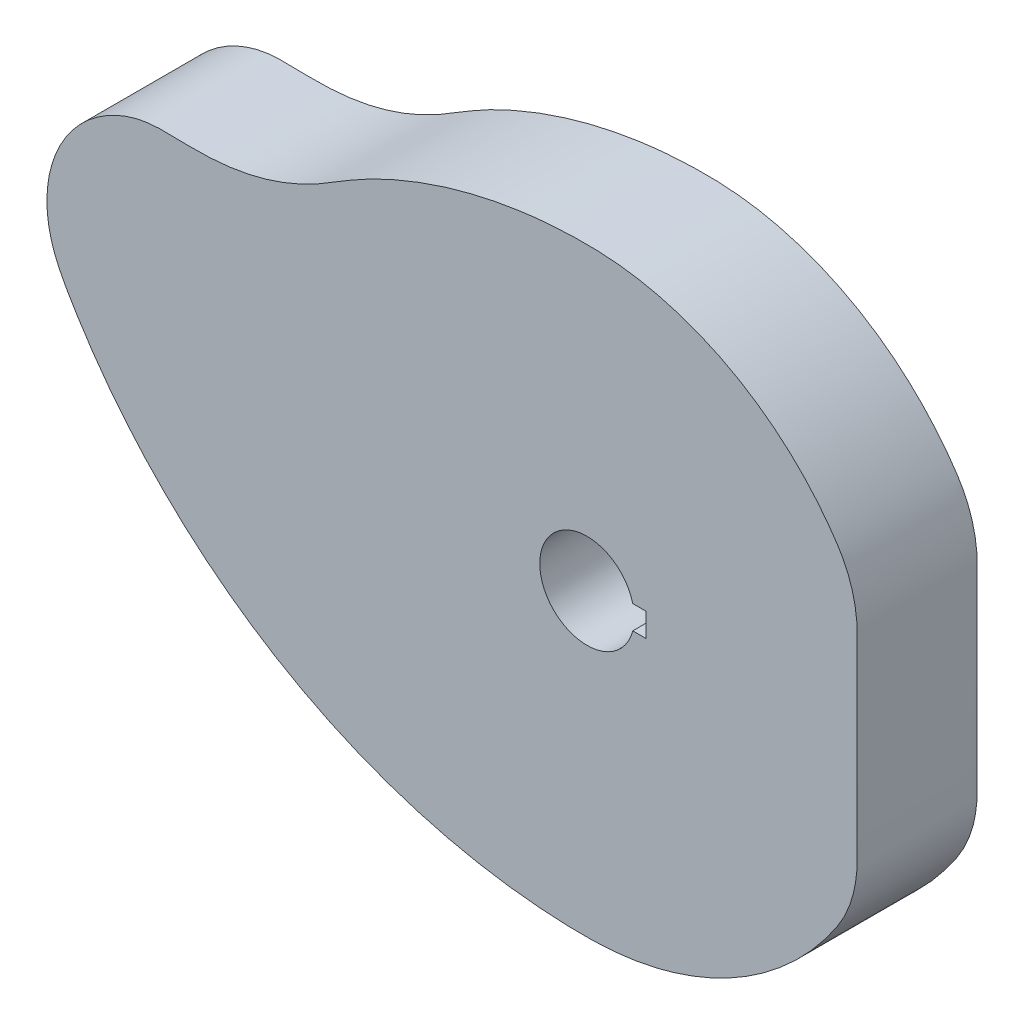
ISO-10303-21;
HEADER;
FILE_DESCRIPTION(('STEP AP214'),'2;1');
FILE_NAME('part.step','',(''),(''),'','','');
FILE_SCHEMA(('AUTOMOTIVE_DESIGN { 1 0 10303 214 1 1 1 1 }'));
ENDSEC;
DATA;
#1=APPLICATION_CONTEXT('core data for automotive mechanical design processes');
#2=APPLICATION_PROTOCOL_DEFINITION('international standard','automotive_design',2000,#1);
#3=PRODUCT_CONTEXT('',#1,'mechanical');
#4=PRODUCT('Part','Part','',(#3));
#5=PRODUCT_RELATED_PRODUCT_CATEGORY('part','',(#4));
#6=PRODUCT_DEFINITION_FORMATION('','',#4);
#7=PRODUCT_DEFINITION_CONTEXT('part definition',#1,'design');
#8=PRODUCT_DEFINITION('design','',#6,#7);
#9=PRODUCT_DEFINITION_SHAPE('','',#8);
#10=(LENGTH_UNIT() NAMED_UNIT(*) SI_UNIT(.MILLI.,.METRE.));
#11=(NAMED_UNIT(*) PLANE_ANGLE_UNIT() SI_UNIT($,.RADIAN.));
#12=(NAMED_UNIT(*) SI_UNIT($,.STERADIAN.) SOLID_ANGLE_UNIT());
#13=UNCERTAINTY_MEASURE_WITH_UNIT(LENGTH_MEASURE(1.E-05),#10,'distance_accuracy_value','');
#14=(GEOMETRIC_REPRESENTATION_CONTEXT(3) GLOBAL_UNCERTAINTY_ASSIGNED_CONTEXT((#13)) GLOBAL_UNIT_ASSIGNED_CONTEXT((#10,
#11,#12)) REPRESENTATION_CONTEXT('',''));
#15=CARTESIAN_POINT('',(0.,0.,0.));
#16=DIRECTION('',(0.,0.,1.));
#17=DIRECTION('',(1.,0.,0.));
#18=AXIS2_PLACEMENT_3D('',#15,#16,#17);
#19=CARTESIAN_POINT('',(-52.1978161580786,-121.578735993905,25.4));
#20=DIRECTION('',(0.,0.,-1.));
#21=DIRECTION('',(-1.,0.,0.));
#22=AXIS2_PLACEMENT_3D('',#19,#20,#21);
#23=PLANE('',#22);
#24=CARTESIAN_POINT('',(-28.84960940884,124.941592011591,25.4));
#25=CARTESIAN_POINT('',(-48.0172973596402,122.192382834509,25.4));
#26=CARTESIAN_POINT('',(-66.6004944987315,116.749663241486,25.4));
#27=CARTESIAN_POINT('',(-84.2227067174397,108.723702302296,25.4));
#28=CARTESIAN_POINT('',(-88.8344062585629,106.623323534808,25.4));
#29=CARTESIAN_POINT('',(-97.900665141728,102.077540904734,25.4));
#30=CARTESIAN_POINT('',(-110.693663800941,93.768091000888,25.4));
#31=CARTESIAN_POINT('',(-119.707980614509,89.0740002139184,25.4));
#32=CARTESIAN_POINT('',(-124.364668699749,87.0753457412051,25.4));
#33=CARTESIAN_POINT('',(-134.644197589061,82.6633632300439,25.4));
#34=CARTESIAN_POINT('',(-145.507212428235,79.9933047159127,25.4));
#35=CARTESIAN_POINT('',(-156.660747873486,79.1371791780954,25.4));
#36=CARTESIAN_POINT('',(-161.496559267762,78.7659908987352,25.4));
#37=CARTESIAN_POINT('',(-171.221339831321,78.7161496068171,25.4));
#38=CARTESIAN_POINT('',(-186.352461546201,79.4198612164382,25.4));
#39=CARTESIAN_POINT('',(-195.681579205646,76.4217455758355,25.4));
#40=CARTESIAN_POINT('',(-200.042029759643,74.2982287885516,25.4));
#41=CARTESIAN_POINT('',(-217.372093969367,65.8585774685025,25.4));
#42=CARTESIAN_POINT('',(-227.881133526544,49.6994027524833,25.4));
#43=CARTESIAN_POINT('',(-228.567760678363,30.4357742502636,25.4));
#44=CARTESIAN_POINT('',(-228.780109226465,24.4782417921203,25.4));
#45=CARTESIAN_POINT('',(-227.107479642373,12.4884203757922,25.4));
#46=CARTESIAN_POINT('',(-217.756575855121,-4.16730423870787,25.4));
#47=CARTESIAN_POINT('',(-211.244905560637,-14.1634767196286,25.4));
#48=CARTESIAN_POINT('',(-207.81736266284,-19.0408976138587,25.4));
#49=CARTESIAN_POINT('',(-165.939670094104,-78.6331883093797,25.4));
#50=CARTESIAN_POINT('',(-103.494941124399,-116.125028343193,25.4));
#51=CARTESIAN_POINT('',(-31.2116151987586,-125.075058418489,25.4));
#52=CARTESIAN_POINT('',(-24.352559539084,-125.924338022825,25.4));
#53=CARTESIAN_POINT('',(-10.5651205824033,-127.062984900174,25.4));
#54=CARTESIAN_POINT('',(10.5782783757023,-127.128584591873,25.4));
#55=CARTESIAN_POINT('',(24.2591569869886,-124.852958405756,25.4));
#56=CARTESIAN_POINT('',(30.9620496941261,-123.167980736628,25.4));
#57=CARTESIAN_POINT('',(59.4391898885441,-116.009378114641,25.4));
#58=CARTESIAN_POINT('',(83.8974747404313,-99.7617503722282,25.4));
#59=CARTESIAN_POINT('',(101.535282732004,-76.2862134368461,25.4));
#60=CARTESIAN_POINT('',(102.527158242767,-74.9660488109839,25.4));
#61=CARTESIAN_POINT('',(104.459414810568,-72.2870303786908,25.4));
#62=CARTESIAN_POINT('',(107.224849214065,-68.1400403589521,25.4));
#63=CARTESIAN_POINT('',(108.775057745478,-65.2195286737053,25.4));
#64=CARTESIAN_POINT('',(109.47729400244,-63.7250334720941,25.4));
#65=CARTESIAN_POINT('',(111.593713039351,-59.2208825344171,25.4));
#66=CARTESIAN_POINT('',(113.030335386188,-54.456145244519,25.4));
#67=CARTESIAN_POINT('',(113.756415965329,-49.5327914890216,25.4));
#68=CARTESIAN_POINT('',(113.876888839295,-48.7158978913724,25.4));
#69=CARTESIAN_POINT('',(114.077999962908,-47.0762360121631,25.4));
#70=CARTESIAN_POINT('',(114.3,-44.5983227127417,25.4));
#71=CARTESIAN_POINT('',(114.3,-42.9468641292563,25.4));
#72=CARTESIAN_POINT('',(114.3,-42.1211348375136,25.4));
#73=CARTESIAN_POINT('',(114.3,-41.2954055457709,25.4));
#74=CARTESIAN_POINT('',(114.3,-39.6439469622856,25.4));
#75=CARTESIAN_POINT('',(114.3,-37.1667590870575,25.4));
#76=CARTESIAN_POINT('',(114.3,-35.5153005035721,25.4));
#77=CARTESIAN_POINT('',(114.3,-34.6895712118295,25.4));
#78=CARTESIAN_POINT('',(114.3,-11.5631904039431,25.4));
#79=CARTESIAN_POINT('',(114.3,11.5631904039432,25.4));
#80=CARTESIAN_POINT('',(114.3,34.6895712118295,25.4));
#81=CARTESIAN_POINT('',(114.3,35.5153005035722,25.4));
#82=CARTESIAN_POINT('',(114.3,37.1667590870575,25.4));
#83=CARTESIAN_POINT('',(114.3,39.6439469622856,25.4));
#84=CARTESIAN_POINT('',(114.3,41.2954055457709,25.4));
#85=CARTESIAN_POINT('',(114.3,42.1211348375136,25.4));
#86=CARTESIAN_POINT('',(114.3,42.9468641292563,25.4));
#87=CARTESIAN_POINT('',(114.3,44.5983227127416,25.4));
#88=CARTESIAN_POINT('',(114.077999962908,47.076236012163,25.4));
#89=CARTESIAN_POINT('',(113.876888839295,48.7158978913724,25.4));
#90=CARTESIAN_POINT('',(113.756415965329,49.5327914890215,25.4));
#91=CARTESIAN_POINT('',(113.030335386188,54.456145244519,25.4));
#92=CARTESIAN_POINT('',(111.593713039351,59.2208825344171,25.4));
#93=CARTESIAN_POINT('',(109.47729400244,63.7250334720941,25.4));
#94=CARTESIAN_POINT('',(108.775057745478,65.2195286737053,25.4));
#95=CARTESIAN_POINT('',(107.224849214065,68.1400403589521,25.4));
#96=CARTESIAN_POINT('',(104.459414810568,72.2870303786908,25.4));
#97=CARTESIAN_POINT('',(102.527158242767,74.9660488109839,25.4));
#98=CARTESIAN_POINT('',(101.535282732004,76.2862134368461,25.4));
#99=CARTESIAN_POINT('',(83.8974747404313,99.7617503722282,25.4));
#100=CARTESIAN_POINT('',(59.4391898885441,116.009378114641,25.4));
#101=CARTESIAN_POINT('',(30.962049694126,123.167980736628,25.4));
#102=CARTESIAN_POINT('',(24.5140011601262,124.788895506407,25.4));
#103=CARTESIAN_POINT('',(11.3633313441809,127.01802686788,25.4));
#104=CARTESIAN_POINT('',(-9.01302025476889,127.127434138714,25.4));
#105=CARTESIAN_POINT('',(-22.2682989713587,125.885545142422,25.4));
#106=CARTESIAN_POINT('',(-28.84960940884,124.941592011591,25.4));
#107=(BOUNDED_CURVE() B_SPLINE_CURVE(3,(#24,#25,#26,#27,#28,#29,#30,#31,#32,#33,#34,#35,#36,#37,
#38,#39,#40,#41,#42,#43,#44,#45,#46,#47,#48,#49,#50,#51,#52,#53,#54,#55,#56,#57,#58,#59,#60,#61,
#62,#63,#64,#65,#66,#67,#68,#69,#70,#71,#72,#73,#74,#75,#76,#77,#78,#79,#80,#81,#82,#83,#84,#85,
#86,#87,#88,#89,#90,#91,#92,#93,#94,#95,#96,#97,#98,#99,#100,#101,#102,#103,#104,#105,#106),
.UNSPECIFIED.,.T.,.F.) B_SPLINE_CURVE_WITH_KNOTS((4,3,1,1,3,3,1,1,3,3,1,1,3,3,1,1,3,3,1,1,3,3,1,
1,3,1,1,3,3,1,1,3,1,1,3,3,1,1,3,3,1,1,4),(0.,0.0612421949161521,0.0773781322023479,
0.0935140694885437,0.109650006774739,0.144949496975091,0.160393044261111,0.175836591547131,
0.19128013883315,0.246815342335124,0.265797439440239,0.284779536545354,0.30376163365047,
0.522402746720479,0.54441022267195,0.566417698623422,0.588425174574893,0.678353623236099,
0.683611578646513,0.688869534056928,0.694127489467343,0.70986101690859,0.712490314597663,
0.715119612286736,0.717748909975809,0.720378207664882,0.723007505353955,0.725636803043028,
0.799276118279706,0.801905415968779,0.804534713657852,0.807164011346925,0.809793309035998,
0.812422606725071,0.815051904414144,0.830785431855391,0.836043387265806,0.84130134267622,
0.846559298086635,0.936487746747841,0.957658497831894,0.978829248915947,1.),
.UNSPECIFIED.) CURVE() GEOMETRIC_REPRESENTATION_ITEM() RATIONAL_B_SPLINE_CURVE((1.,
0.993246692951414,0.993246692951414,1.,1.,1.,1.,1.,1.,0.991010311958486,0.991010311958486,1.,1.,
1.,1.,1.,1.,0.904799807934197,0.904799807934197,1.,1.,1.,1.,1.,1.,0.942731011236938,
0.942731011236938,1.,1.,1.,1.,1.,1.,0.961817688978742,0.961817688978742,1.,1.,1.,1.,1.,1.,
0.992866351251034,0.992866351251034,1.,1.,1.,1.,1.,1.,1.,1.,1.,1.,1.,1.,1.,1.,1.,1.,1.,1.,1.,1.,
1.,1.,1.,1.,0.992866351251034,0.992866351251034,1.,1.,1.,1.,1.,1.,0.961817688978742,
0.961817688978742,1.,1.,1.,1.,1.,1.)) REPRESENTATION_ITEM(''));
#108=CARTESIAN_POINT('',(-28.84960940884,124.941592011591,25.4));
#109=VERTEX_POINT('',#108);
#110=EDGE_CURVE('E11',#109,#109,#107,.T.);
#111=ORIENTED_EDGE('',*,*,#110,.T.);
#112=EDGE_LOOP('',(#111));
#113=FACE_BOUND('',#112,.T.);
#114=DIRECTION('',(0.,1.,0.));
#115=VECTOR('',#114,1.);
#116=CARTESIAN_POINT('',(25.,5.,25.4));
#117=LINE('',#116,#115);
#118=CARTESIAN_POINT('',(25.,-5.,25.4));
#119=VERTEX_POINT('',#118);
#120=CARTESIAN_POINT('',(25.,5.,25.4));
#121=VERTEX_POINT('',#120);
#122=EDGE_CURVE('E75',#119,#121,#117,.T.);
#123=ORIENTED_EDGE('',*,*,#122,.F.);
#124=DIRECTION('',(1.,0.,0.));
#125=VECTOR('',#124,1.);
#126=CARTESIAN_POINT('',(19.3649167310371,-5.,25.4));
#127=LINE('',#126,#125);
#128=CARTESIAN_POINT('',(19.3649167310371,-5.,25.4));
#129=VERTEX_POINT('',#128);
#130=EDGE_CURVE('E96',#129,#119,#127,.T.);
#131=ORIENTED_EDGE('',*,*,#130,.F.);
#132=CARTESIAN_POINT('',(0.,0.,25.4));
#133=DIRECTION('',(0.,0.,1.));
#134=DIRECTION('',(1.,0.,0.));
#135=AXIS2_PLACEMENT_3D('',#132,#133,#134);
#136=CIRCLE('',#135,20.);
#137=CARTESIAN_POINT('',(19.3649167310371,5.,25.4));
#138=VERTEX_POINT('',#137);
#139=EDGE_CURVE('E94',#138,#129,#136,.T.);
#140=ORIENTED_EDGE('',*,*,#139,.F.);
#141=DIRECTION('',(-1.,0.,0.));
#142=VECTOR('',#141,1.);
#143=CARTESIAN_POINT('',(19.3649167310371,5.,25.4));
#144=LINE('',#143,#142);
#145=EDGE_CURVE('E83',#121,#138,#144,.T.);
#146=ORIENTED_EDGE('',*,*,#145,.F.);
#147=EDGE_LOOP('',(#123,#131,#140,#146));
#148=FACE_BOUND('',#147,.T.);
#149=ADVANCED_FACE('F32',(#113,#148),#23,.F.);
#150=CARTESIAN_POINT('',(-52.1978161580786,-121.578735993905,-25.4));
#151=DIRECTION('',(0.,0.,-1.));
#152=DIRECTION('',(-1.,0.,0.));
#153=AXIS2_PLACEMENT_3D('',#150,#151,#152);
#154=PLANE('',#153);
#155=CARTESIAN_POINT('',(-28.84960940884,124.941592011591,-25.4));
#156=CARTESIAN_POINT('',(-48.0172973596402,122.192382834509,-25.4));
#157=CARTESIAN_POINT('',(-66.6004944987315,116.749663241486,-25.4));
#158=CARTESIAN_POINT('',(-84.2227067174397,108.723702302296,-25.4));
#159=CARTESIAN_POINT('',(-88.8344062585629,106.623323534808,-25.4));
#160=CARTESIAN_POINT('',(-97.900665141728,102.077540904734,-25.4));
#161=CARTESIAN_POINT('',(-110.693663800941,93.768091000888,-25.4));
#162=CARTESIAN_POINT('',(-119.707980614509,89.0740002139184,-25.4));
#163=CARTESIAN_POINT('',(-124.364668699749,87.0753457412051,-25.4));
#164=CARTESIAN_POINT('',(-134.644197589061,82.6633632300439,-25.4));
#165=CARTESIAN_POINT('',(-145.507212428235,79.9933047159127,-25.4));
#166=CARTESIAN_POINT('',(-156.660747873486,79.1371791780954,-25.4));
#167=CARTESIAN_POINT('',(-161.496559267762,78.7659908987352,-25.4));
#168=CARTESIAN_POINT('',(-171.221339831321,78.7161496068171,-25.4));
#169=CARTESIAN_POINT('',(-186.352461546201,79.4198612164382,-25.4));
#170=CARTESIAN_POINT('',(-195.681579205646,76.4217455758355,-25.4));
#171=CARTESIAN_POINT('',(-200.042029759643,74.2982287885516,-25.4));
#172=CARTESIAN_POINT('',(-217.372093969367,65.8585774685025,-25.4));
#173=CARTESIAN_POINT('',(-227.881133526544,49.6994027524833,-25.4));
#174=CARTESIAN_POINT('',(-228.567760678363,30.4357742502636,-25.4));
#175=CARTESIAN_POINT('',(-228.780109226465,24.4782417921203,-25.4));
#176=CARTESIAN_POINT('',(-227.107479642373,12.4884203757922,-25.4));
#177=CARTESIAN_POINT('',(-217.756575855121,-4.16730423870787,-25.4));
#178=CARTESIAN_POINT('',(-211.244905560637,-14.1634767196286,-25.4));
#179=CARTESIAN_POINT('',(-207.81736266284,-19.0408976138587,-25.4));
#180=CARTESIAN_POINT('',(-165.939670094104,-78.6331883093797,-25.4));
#181=CARTESIAN_POINT('',(-103.494941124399,-116.125028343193,-25.4));
#182=CARTESIAN_POINT('',(-31.2116151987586,-125.075058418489,-25.4));
#183=CARTESIAN_POINT('',(-24.352559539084,-125.924338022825,-25.4));
#184=CARTESIAN_POINT('',(-10.5651205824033,-127.062984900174,-25.4));
#185=CARTESIAN_POINT('',(10.5782783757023,-127.128584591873,-25.4));
#186=CARTESIAN_POINT('',(24.2591569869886,-124.852958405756,-25.4));
#187=CARTESIAN_POINT('',(30.9620496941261,-123.167980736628,-25.4));
#188=CARTESIAN_POINT('',(59.4391898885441,-116.009378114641,-25.4));
#189=CARTESIAN_POINT('',(83.8974747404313,-99.7617503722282,-25.4));
#190=CARTESIAN_POINT('',(101.535282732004,-76.2862134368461,-25.4));
#191=CARTESIAN_POINT('',(102.527158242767,-74.9660488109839,-25.4));
#192=CARTESIAN_POINT('',(104.459414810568,-72.2870303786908,-25.4));
#193=CARTESIAN_POINT('',(107.224849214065,-68.1400403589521,-25.4));
#194=CARTESIAN_POINT('',(108.775057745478,-65.2195286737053,-25.4));
#195=CARTESIAN_POINT('',(109.47729400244,-63.7250334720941,-25.4));
#196=CARTESIAN_POINT('',(111.593713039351,-59.2208825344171,-25.4));
#197=CARTESIAN_POINT('',(113.030335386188,-54.456145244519,-25.4));
#198=CARTESIAN_POINT('',(113.756415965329,-49.5327914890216,-25.4));
#199=CARTESIAN_POINT('',(113.876888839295,-48.7158978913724,-25.4));
#200=CARTESIAN_POINT('',(114.077999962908,-47.0762360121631,-25.4));
#201=CARTESIAN_POINT('',(114.3,-44.5983227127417,-25.4));
#202=CARTESIAN_POINT('',(114.3,-42.9468641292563,-25.4));
#203=CARTESIAN_POINT('',(114.3,-42.1211348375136,-25.4));
#204=CARTESIAN_POINT('',(114.3,-41.2954055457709,-25.4));
#205=CARTESIAN_POINT('',(114.3,-39.6439469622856,-25.4));
#206=CARTESIAN_POINT('',(114.3,-37.1667590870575,-25.4));
#207=CARTESIAN_POINT('',(114.3,-35.5153005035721,-25.4));
#208=CARTESIAN_POINT('',(114.3,-34.6895712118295,-25.4));
#209=CARTESIAN_POINT('',(114.3,-11.5631904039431,-25.4));
#210=CARTESIAN_POINT('',(114.3,11.5631904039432,-25.4));
#211=CARTESIAN_POINT('',(114.3,34.6895712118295,-25.4));
#212=CARTESIAN_POINT('',(114.3,35.5153005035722,-25.4));
#213=CARTESIAN_POINT('',(114.3,37.1667590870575,-25.4));
#214=CARTESIAN_POINT('',(114.3,39.6439469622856,-25.4));
#215=CARTESIAN_POINT('',(114.3,41.2954055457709,-25.4));
#216=CARTESIAN_POINT('',(114.3,42.1211348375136,-25.4));
#217=CARTESIAN_POINT('',(114.3,42.9468641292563,-25.4));
#218=CARTESIAN_POINT('',(114.3,44.5983227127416,-25.4));
#219=CARTESIAN_POINT('',(114.077999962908,47.076236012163,-25.4));
#220=CARTESIAN_POINT('',(113.876888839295,48.7158978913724,-25.4));
#221=CARTESIAN_POINT('',(113.756415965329,49.5327914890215,-25.4));
#222=CARTESIAN_POINT('',(113.030335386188,54.456145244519,-25.4));
#223=CARTESIAN_POINT('',(111.593713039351,59.2208825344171,-25.4));
#224=CARTESIAN_POINT('',(109.47729400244,63.7250334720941,-25.4));
#225=CARTESIAN_POINT('',(108.775057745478,65.2195286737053,-25.4));
#226=CARTESIAN_POINT('',(107.224849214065,68.1400403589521,-25.4));
#227=CARTESIAN_POINT('',(104.459414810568,72.2870303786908,-25.4));
#228=CARTESIAN_POINT('',(102.527158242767,74.9660488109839,-25.4));
#229=CARTESIAN_POINT('',(101.535282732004,76.2862134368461,-25.4));
#230=CARTESIAN_POINT('',(83.8974747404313,99.7617503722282,-25.4));
#231=CARTESIAN_POINT('',(59.4391898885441,116.009378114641,-25.4));
#232=CARTESIAN_POINT('',(30.962049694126,123.167980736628,-25.4));
#233=CARTESIAN_POINT('',(24.5140011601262,124.788895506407,-25.4));
#234=CARTESIAN_POINT('',(11.3633313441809,127.01802686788,-25.4));
#235=CARTESIAN_POINT('',(-9.01302025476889,127.127434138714,-25.4));
#236=CARTESIAN_POINT('',(-22.2682989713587,125.885545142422,-25.4));
#237=CARTESIAN_POINT('',(-28.84960940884,124.941592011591,-25.4));
#238=(BOUNDED_CURVE() B_SPLINE_CURVE(3,(#155,#156,#157,#158,#159,#160,#161,#162,#163,#164,#165,
#166,#167,#168,#169,#170,#171,#172,#173,#174,#175,#176,#177,#178,#179,#180,#181,#182,#183,#184,
#185,#186,#187,#188,#189,#190,#191,#192,#193,#194,#195,#196,#197,#198,#199,#200,#201,#202,#203,
#204,#205,#206,#207,#208,#209,#210,#211,#212,#213,#214,#215,#216,#217,#218,#219,#220,#221,#222,
#223,#224,#225,#226,#227,#228,#229,#230,#231,#232,#233,#234,#235,#236,#237),.UNSPECIFIED.,.T.,
.F.) B_SPLINE_CURVE_WITH_KNOTS((4,3,1,1,3,3,1,1,3,3,1,1,3,3,1,1,3,3,1,1,3,3,1,1,3,1,1,3,3,1,1,3,
1,1,3,3,1,1,3,3,1,1,4),(0.,0.0612421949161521,0.0773781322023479,0.0935140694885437,
0.109650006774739,0.144949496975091,0.160393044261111,0.175836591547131,0.19128013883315,
0.246815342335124,0.265797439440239,0.284779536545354,0.30376163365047,0.522402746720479,
0.54441022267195,0.566417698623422,0.588425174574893,0.678353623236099,0.683611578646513,
0.688869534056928,0.694127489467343,0.70986101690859,0.712490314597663,0.715119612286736,
0.717748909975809,0.720378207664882,0.723007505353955,0.725636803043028,0.799276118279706,
0.801905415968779,0.804534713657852,0.807164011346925,0.809793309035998,0.812422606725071,
0.815051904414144,0.830785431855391,0.836043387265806,0.84130134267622,0.846559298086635,
0.936487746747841,0.957658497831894,0.978829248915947,1.),
.UNSPECIFIED.) CURVE() GEOMETRIC_REPRESENTATION_ITEM() RATIONAL_B_SPLINE_CURVE((1.,
0.993246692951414,0.993246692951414,1.,1.,1.,1.,1.,1.,0.991010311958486,0.991010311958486,1.,1.,
1.,1.,1.,1.,0.904799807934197,0.904799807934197,1.,1.,1.,1.,1.,1.,0.942731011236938,
0.942731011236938,1.,1.,1.,1.,1.,1.,0.961817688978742,0.961817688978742,1.,1.,1.,1.,1.,1.,
0.992866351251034,0.992866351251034,1.,1.,1.,1.,1.,1.,1.,1.,1.,1.,1.,1.,1.,1.,1.,1.,1.,1.,1.,1.,
1.,1.,1.,1.,0.992866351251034,0.992866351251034,1.,1.,1.,1.,1.,1.,0.961817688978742,
0.961817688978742,1.,1.,1.,1.,1.,1.)) REPRESENTATION_ITEM(''));
#239=CARTESIAN_POINT('',(-28.84960940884,124.941592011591,-25.4));
#240=VERTEX_POINT('',#239);
#241=EDGE_CURVE('E37',#240,#240,#238,.T.);
#242=ORIENTED_EDGE('',*,*,#241,.F.);
#243=EDGE_LOOP('',(#242));
#244=FACE_BOUND('',#243,.T.);
#245=DIRECTION('',(1.,0.,0.));
#246=VECTOR('',#245,1.);
#247=CARTESIAN_POINT('',(19.3649167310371,-5.,-25.4));
#248=LINE('',#247,#246);
#249=CARTESIAN_POINT('',(19.3649167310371,-5.,-25.4));
#250=VERTEX_POINT('',#249);
#251=CARTESIAN_POINT('',(25.,-5.,-25.4));
#252=VERTEX_POINT('',#251);
#253=EDGE_CURVE('E84',#250,#252,#248,.T.);
#254=ORIENTED_EDGE('',*,*,#253,.T.);
#255=DIRECTION('',(0.,1.,0.));
#256=VECTOR('',#255,1.);
#257=CARTESIAN_POINT('',(25.,5.,-25.4));
#258=LINE('',#257,#256);
#259=CARTESIAN_POINT('',(25.,5.,-25.4));
#260=VERTEX_POINT('',#259);
#261=EDGE_CURVE('E57',#252,#260,#258,.T.);
#262=ORIENTED_EDGE('',*,*,#261,.T.);
#263=DIRECTION('',(-1.,0.,0.));
#264=VECTOR('',#263,1.);
#265=CARTESIAN_POINT('',(19.3649167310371,5.,-25.4));
#266=LINE('',#265,#264);
#267=CARTESIAN_POINT('',(19.3649167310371,5.,-25.4));
#268=VERTEX_POINT('',#267);
#269=EDGE_CURVE('E90',#260,#268,#266,.T.);
#270=ORIENTED_EDGE('',*,*,#269,.T.);
#271=CARTESIAN_POINT('',(0.,0.,-25.4));
#272=DIRECTION('',(0.,0.,1.));
#273=DIRECTION('',(1.,0.,0.));
#274=AXIS2_PLACEMENT_3D('',#271,#272,#273);
#275=CIRCLE('',#274,20.);
#276=EDGE_CURVE('E102',#268,#250,#275,.T.);
#277=ORIENTED_EDGE('',*,*,#276,.T.);
#278=EDGE_LOOP('',(#254,#262,#270,#277));
#279=FACE_BOUND('',#278,.T.);
#280=ADVANCED_FACE('F119',(#244,#279),#154,.T.);
#281=DIRECTION('',(0.,0.,-1.));
#282=VECTOR('',#281,1.);
#283=SURFACE_OF_LINEAR_EXTRUSION('',#107,#282);
#284=ORIENTED_EDGE('',*,*,#110,.F.);
#285=EDGE_LOOP('',(#284));
#286=FACE_BOUND('',#285,.T.);
#287=ORIENTED_EDGE('',*,*,#241,.T.);
#288=EDGE_LOOP('',(#287));
#289=FACE_BOUND('',#288,.T.);
#290=ADVANCED_FACE('F34',(#286,#289),#283,.F.);
#291=CARTESIAN_POINT('',(25.,5.,25.4));
#292=DIRECTION('',(-1.,0.,0.));
#293=DIRECTION('',(0.,0.,1.));
#294=AXIS2_PLACEMENT_3D('',#291,#292,#293);
#295=PLANE('',#294);
#296=ORIENTED_EDGE('',*,*,#261,.F.);
#297=DIRECTION('',(0.,0.,-1.));
#298=VECTOR('',#297,1.);
#299=CARTESIAN_POINT('',(25.,-5.,25.4));
#300=LINE('',#299,#298);
#301=EDGE_CURVE('E79',#119,#252,#300,.T.);
#302=ORIENTED_EDGE('',*,*,#301,.F.);
#303=ORIENTED_EDGE('',*,*,#122,.T.);
#304=DIRECTION('',(0.,0.,-1.));
#305=VECTOR('',#304,1.);
#306=CARTESIAN_POINT('',(25.,5.,25.4));
#307=LINE('',#306,#305);
#308=EDGE_CURVE('E78',#121,#260,#307,.T.);
#309=ORIENTED_EDGE('',*,*,#308,.T.);
#310=EDGE_LOOP('',(#296,#302,#303,#309));
#311=FACE_BOUND('',#310,.T.);
#312=ADVANCED_FACE('F77',(#311),#295,.T.);
#313=CARTESIAN_POINT('',(19.3649167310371,5.,25.4));
#314=DIRECTION('',(0.,-1.,0.));
#315=DIRECTION('',(0.,0.,-1.));
#316=AXIS2_PLACEMENT_3D('',#313,#314,#315);
#317=PLANE('',#316);
#318=ORIENTED_EDGE('',*,*,#269,.F.);
#319=ORIENTED_EDGE('',*,*,#308,.F.);
#320=ORIENTED_EDGE('',*,*,#145,.T.);
#321=DIRECTION('',(0.,0.,-1.));
#322=VECTOR('',#321,1.);
#323=CARTESIAN_POINT('',(19.3649167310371,5.,25.4));
#324=LINE('',#323,#322);
#325=EDGE_CURVE('E91',#138,#268,#324,.T.);
#326=ORIENTED_EDGE('',*,*,#325,.T.);
#327=EDGE_LOOP('',(#318,#319,#320,#326));
#328=FACE_BOUND('',#327,.T.);
#329=ADVANCED_FACE('F87',(#328),#317,.T.);
#330=CARTESIAN_POINT('',(0.,0.,25.4));
#331=DIRECTION('',(0.,0.,-1.));
#332=DIRECTION('',(-1.,0.,0.));
#333=AXIS2_PLACEMENT_3D('',#330,#331,#332);
#334=CYLINDRICAL_SURFACE('',#333,20.);
#335=ORIENTED_EDGE('',*,*,#276,.F.);
#336=ORIENTED_EDGE('',*,*,#325,.F.);
#337=ORIENTED_EDGE('',*,*,#139,.T.);
#338=DIRECTION('',(0.,0.,-1.));
#339=VECTOR('',#338,1.);
#340=CARTESIAN_POINT('',(19.3649167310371,-5.,25.4));
#341=LINE('',#340,#339);
#342=EDGE_CURVE('E49',#129,#250,#341,.T.);
#343=ORIENTED_EDGE('',*,*,#342,.T.);
#344=EDGE_LOOP('',(#335,#336,#337,#343));
#345=FACE_BOUND('',#344,.T.);
#346=ADVANCED_FACE('F117',(#345),#334,.F.);
#347=CARTESIAN_POINT('',(19.3649167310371,-5.,25.4));
#348=DIRECTION('',(0.,1.,0.));
#349=DIRECTION('',(0.,0.,1.));
#350=AXIS2_PLACEMENT_3D('',#347,#348,#349);
#351=PLANE('',#350);
#352=ORIENTED_EDGE('',*,*,#253,.F.);
#353=ORIENTED_EDGE('',*,*,#342,.F.);
#354=ORIENTED_EDGE('',*,*,#130,.T.);
#355=ORIENTED_EDGE('',*,*,#301,.T.);
#356=EDGE_LOOP('',(#352,#353,#354,#355));
#357=FACE_BOUND('',#356,.T.);
#358=ADVANCED_FACE('F120',(#357),#351,.T.);
#359=CLOSED_SHELL('',(#149,#280,#290,#312,#329,#346,#358));
#360=MANIFOLD_SOLID_BREP('B2',#359);
#361=ADVANCED_BREP_SHAPE_REPRESENTATION('',(#18,#360),#14);
#362=SHAPE_DEFINITION_REPRESENTATION(#9,#361);
ENDSEC;
END-ISO-10303-21;
